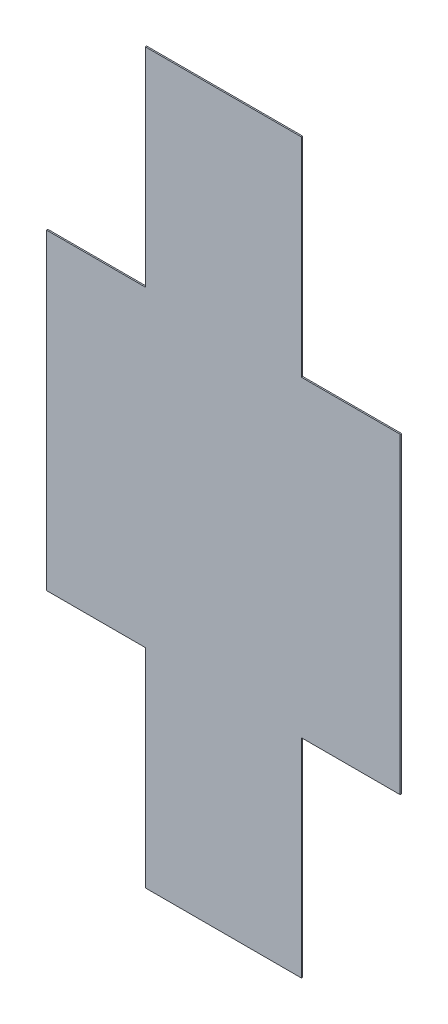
ISO-10303-21;
HEADER;
FILE_DESCRIPTION(('STEP AP214'),'2;1');
FILE_NAME('part.step','',(''),(''),'','','');
FILE_SCHEMA(('AUTOMOTIVE_DESIGN { 1 0 10303 214 1 1 1 1 }'));
ENDSEC;
DATA;
#1=APPLICATION_CONTEXT('core data for automotive mechanical design processes');
#2=APPLICATION_PROTOCOL_DEFINITION('international standard','automotive_design',2000,#1);
#3=PRODUCT_CONTEXT('',#1,'mechanical');
#4=PRODUCT('Part','Part','',(#3));
#5=PRODUCT_RELATED_PRODUCT_CATEGORY('part','',(#4));
#6=PRODUCT_DEFINITION_FORMATION('','',#4);
#7=PRODUCT_DEFINITION_CONTEXT('part definition',#1,'design');
#8=PRODUCT_DEFINITION('design','',#6,#7);
#9=PRODUCT_DEFINITION_SHAPE('','',#8);
#10=(LENGTH_UNIT() NAMED_UNIT(*) SI_UNIT(.MILLI.,.METRE.));
#11=(NAMED_UNIT(*) PLANE_ANGLE_UNIT() SI_UNIT($,.RADIAN.));
#12=(NAMED_UNIT(*) SI_UNIT($,.STERADIAN.) SOLID_ANGLE_UNIT());
#13=UNCERTAINTY_MEASURE_WITH_UNIT(LENGTH_MEASURE(1.E-05),#10,'distance_accuracy_value','');
#14=(GEOMETRIC_REPRESENTATION_CONTEXT(3) GLOBAL_UNCERTAINTY_ASSIGNED_CONTEXT((#13)) GLOBAL_UNIT_ASSIGNED_CONTEXT((#10,
#11,#12)) REPRESENTATION_CONTEXT('',''));
#15=CARTESIAN_POINT('',(0.,0.,0.));
#16=DIRECTION('',(0.,0.,1.));
#17=DIRECTION('',(1.,0.,0.));
#18=AXIS2_PLACEMENT_3D('',#15,#16,#17);
#19=CARTESIAN_POINT('',(-38.,35.,0.13));
#20=DIRECTION('',(0.,-1.,0.));
#21=DIRECTION('',(0.,0.,-1.));
#22=AXIS2_PLACEMENT_3D('',#19,#20,#21);
#23=PLANE('',#22);
#24=DIRECTION('',(-1.,0.,0.));
#25=VECTOR('',#24,1.);
#26=CARTESIAN_POINT('',(-38.,35.,0.));
#27=LINE('',#26,#25);
#28=CARTESIAN_POINT('',(7.5,35.,0.));
#29=VERTEX_POINT('',#28);
#30=CARTESIAN_POINT('',(-7.5,35.,0.));
#31=VERTEX_POINT('',#30);
#32=EDGE_CURVE('E150',#29,#31,#27,.T.);
#33=ORIENTED_EDGE('',*,*,#32,.T.);
#34=DIRECTION('',(0.,0.,1.));
#35=VECTOR('',#34,1.);
#36=CARTESIAN_POINT('',(-7.5,35.,0.));
#37=LINE('',#36,#35);
#38=CARTESIAN_POINT('',(-7.5,35.,0.13));
#39=VERTEX_POINT('',#38);
#40=EDGE_CURVE('E154',#31,#39,#37,.T.);
#41=ORIENTED_EDGE('',*,*,#40,.T.);
#42=DIRECTION('',(-1.,0.,0.));
#43=VECTOR('',#42,1.);
#44=CARTESIAN_POINT('',(-38.,35.,0.13));
#45=LINE('',#44,#43);
#46=CARTESIAN_POINT('',(7.5,35.,0.13));
#47=VERTEX_POINT('',#46);
#48=EDGE_CURVE('E45',#47,#39,#45,.T.);
#49=ORIENTED_EDGE('',*,*,#48,.F.);
#50=DIRECTION('',(0.,0.,1.));
#51=VECTOR('',#50,1.);
#52=CARTESIAN_POINT('',(7.5,35.,0.));
#53=LINE('',#52,#51);
#54=EDGE_CURVE('E188',#29,#47,#53,.T.);
#55=ORIENTED_EDGE('',*,*,#54,.F.);
#56=EDGE_LOOP('',(#33,#41,#49,#55));
#57=FACE_BOUND('',#56,.T.);
#58=ADVANCED_FACE('F37',(#57),#23,.F.);
#59=CARTESIAN_POINT('',(-38.,-35.,0.13));
#60=DIRECTION('',(0.,1.,0.));
#61=DIRECTION('',(0.,0.,1.));
#62=AXIS2_PLACEMENT_3D('',#59,#60,#61);
#63=PLANE('',#62);
#64=DIRECTION('',(1.,0.,0.));
#65=VECTOR('',#64,1.);
#66=CARTESIAN_POINT('',(-38.,-35.,0.13));
#67=LINE('',#66,#65);
#68=CARTESIAN_POINT('',(-7.5,-35.,0.13));
#69=VERTEX_POINT('',#68);
#70=CARTESIAN_POINT('',(7.5,-35.,0.13));
#71=VERTEX_POINT('',#70);
#72=EDGE_CURVE('E11',#69,#71,#67,.T.);
#73=ORIENTED_EDGE('',*,*,#72,.F.);
#74=DIRECTION('',(0.,0.,1.));
#75=VECTOR('',#74,1.);
#76=CARTESIAN_POINT('',(-7.5,-35.,0.));
#77=LINE('',#76,#75);
#78=CARTESIAN_POINT('',(-7.5,-35.,0.));
#79=VERTEX_POINT('',#78);
#80=EDGE_CURVE('E130',#79,#69,#77,.T.);
#81=ORIENTED_EDGE('',*,*,#80,.F.);
#82=DIRECTION('',(1.,0.,0.));
#83=VECTOR('',#82,1.);
#84=CARTESIAN_POINT('',(-38.,-35.,0.));
#85=LINE('',#84,#83);
#86=CARTESIAN_POINT('',(7.5,-35.,0.));
#87=VERTEX_POINT('',#86);
#88=EDGE_CURVE('E40',#79,#87,#85,.T.);
#89=ORIENTED_EDGE('',*,*,#88,.T.);
#90=DIRECTION('',(0.,0.,1.));
#91=VECTOR('',#90,1.);
#92=CARTESIAN_POINT('',(7.5,-35.,0.));
#93=LINE('',#92,#91);
#94=EDGE_CURVE('E190',#87,#71,#93,.T.);
#95=ORIENTED_EDGE('',*,*,#94,.T.);
#96=EDGE_LOOP('',(#73,#81,#89,#95));
#97=FACE_BOUND('',#96,.T.);
#98=ADVANCED_FACE('F140',(#97),#63,.F.);
#99=CARTESIAN_POINT('',(0.,0.,0.13));
#100=DIRECTION('',(0.,0.,1.));
#101=DIRECTION('',(1.,0.,0.));
#102=AXIS2_PLACEMENT_3D('',#99,#100,#101);
#103=PLANE('',#102);
#104=DIRECTION('',(0.,1.,0.));
#105=VECTOR('',#104,1.);
#106=CARTESIAN_POINT('',(-7.5,35.,0.13));
#107=LINE('',#106,#105);
#108=CARTESIAN_POINT('',(-7.5,15.,0.13));
#109=VERTEX_POINT('',#108);
#110=EDGE_CURVE('E135',#109,#39,#107,.T.);
#111=ORIENTED_EDGE('',*,*,#110,.F.);
#112=DIRECTION('',(1.,0.,0.));
#113=VECTOR('',#112,1.);
#114=CARTESIAN_POINT('',(-17.,15.,0.13));
#115=LINE('',#114,#113);
#116=CARTESIAN_POINT('',(-17.,15.,0.13));
#117=VERTEX_POINT('',#116);
#118=EDGE_CURVE('E206',#117,#109,#115,.T.);
#119=ORIENTED_EDGE('',*,*,#118,.F.);
#120=DIRECTION('',(0.,1.,0.));
#121=VECTOR('',#120,1.);
#122=CARTESIAN_POINT('',(-17.,-15.,0.13));
#123=LINE('',#122,#121);
#124=CARTESIAN_POINT('',(-17.,-15.,0.13));
#125=VERTEX_POINT('',#124);
#126=EDGE_CURVE('E209',#125,#117,#123,.T.);
#127=ORIENTED_EDGE('',*,*,#126,.F.);
#128=DIRECTION('',(-1.,0.,0.));
#129=VECTOR('',#128,1.);
#130=CARTESIAN_POINT('',(-17.,-15.,0.13));
#131=LINE('',#130,#129);
#132=CARTESIAN_POINT('',(-7.5,-15.,0.13));
#133=VERTEX_POINT('',#132);
#134=EDGE_CURVE('E212',#133,#125,#131,.T.);
#135=ORIENTED_EDGE('',*,*,#134,.F.);
#136=DIRECTION('',(0.,1.,0.));
#137=VECTOR('',#136,1.);
#138=CARTESIAN_POINT('',(-7.5,-35.,0.13));
#139=LINE('',#138,#137);
#140=EDGE_CURVE('E177',#69,#133,#139,.T.);
#141=ORIENTED_EDGE('',*,*,#140,.F.);
#142=ORIENTED_EDGE('',*,*,#72,.T.);
#143=DIRECTION('',(0.,-1.,0.));
#144=VECTOR('',#143,1.);
#145=CARTESIAN_POINT('',(7.5,-35.,0.13));
#146=LINE('',#145,#144);
#147=CARTESIAN_POINT('',(7.5,-15.,0.13));
#148=VERTEX_POINT('',#147);
#149=EDGE_CURVE('E165',#148,#71,#146,.T.);
#150=ORIENTED_EDGE('',*,*,#149,.F.);
#151=DIRECTION('',(-1.,0.,0.));
#152=VECTOR('',#151,1.);
#153=CARTESIAN_POINT('',(17.,-15.,0.13));
#154=LINE('',#153,#152);
#155=CARTESIAN_POINT('',(17.,-15.,0.13));
#156=VERTEX_POINT('',#155);
#157=EDGE_CURVE('E184',#156,#148,#154,.T.);
#158=ORIENTED_EDGE('',*,*,#157,.F.);
#159=DIRECTION('',(0.,-1.,0.));
#160=VECTOR('',#159,1.);
#161=CARTESIAN_POINT('',(17.,-15.,0.13));
#162=LINE('',#161,#160);
#163=CARTESIAN_POINT('',(17.,15.,0.13));
#164=VERTEX_POINT('',#163);
#165=EDGE_CURVE('E181',#164,#156,#162,.T.);
#166=ORIENTED_EDGE('',*,*,#165,.F.);
#167=DIRECTION('',(1.,0.,0.));
#168=VECTOR('',#167,1.);
#169=CARTESIAN_POINT('',(17.,15.,0.13));
#170=LINE('',#169,#168);
#171=CARTESIAN_POINT('',(7.5,15.,0.13));
#172=VERTEX_POINT('',#171);
#173=EDGE_CURVE('E178',#172,#164,#170,.T.);
#174=ORIENTED_EDGE('',*,*,#173,.F.);
#175=DIRECTION('',(0.,-1.,0.));
#176=VECTOR('',#175,1.);
#177=CARTESIAN_POINT('',(7.5,35.,0.13));
#178=LINE('',#177,#176);
#179=EDGE_CURVE('E174',#47,#172,#178,.T.);
#180=ORIENTED_EDGE('',*,*,#179,.F.);
#181=ORIENTED_EDGE('',*,*,#48,.T.);
#182=EDGE_LOOP('',(#111,#119,#127,#135,#141,#142,#150,#158,#166,#174,#180,#181));
#183=FACE_BOUND('',#182,.T.);
#184=ADVANCED_FACE('F241',(#183),#103,.T.);
#185=CARTESIAN_POINT('',(0.,0.,0.));
#186=DIRECTION('',(0.,0.,1.));
#187=DIRECTION('',(1.,0.,0.));
#188=AXIS2_PLACEMENT_3D('',#185,#186,#187);
#189=PLANE('',#188);
#190=DIRECTION('',(1.,0.,0.));
#191=VECTOR('',#190,1.);
#192=CARTESIAN_POINT('',(-17.,15.,0.));
#193=LINE('',#192,#191);
#194=CARTESIAN_POINT('',(-17.,15.,0.));
#195=VERTEX_POINT('',#194);
#196=CARTESIAN_POINT('',(-7.5,15.,0.));
#197=VERTEX_POINT('',#196);
#198=EDGE_CURVE('E218',#195,#197,#193,.T.);
#199=ORIENTED_EDGE('',*,*,#198,.T.);
#200=DIRECTION('',(0.,1.,0.));
#201=VECTOR('',#200,1.);
#202=CARTESIAN_POINT('',(-7.5,35.,0.));
#203=LINE('',#202,#201);
#204=EDGE_CURVE('E142',#197,#31,#203,.T.);
#205=ORIENTED_EDGE('',*,*,#204,.T.);
#206=ORIENTED_EDGE('',*,*,#32,.F.);
#207=DIRECTION('',(0.,-1.,0.));
#208=VECTOR('',#207,1.);
#209=CARTESIAN_POINT('',(7.5,35.,0.));
#210=LINE('',#209,#208);
#211=CARTESIAN_POINT('',(7.5,15.,0.));
#212=VERTEX_POINT('',#211);
#213=EDGE_CURVE('E162',#29,#212,#210,.T.);
#214=ORIENTED_EDGE('',*,*,#213,.T.);
#215=DIRECTION('',(1.,0.,0.));
#216=VECTOR('',#215,1.);
#217=CARTESIAN_POINT('',(17.,15.,0.));
#218=LINE('',#217,#216);
#219=CARTESIAN_POINT('',(17.,15.,0.));
#220=VERTEX_POINT('',#219);
#221=EDGE_CURVE('E166',#212,#220,#218,.T.);
#222=ORIENTED_EDGE('',*,*,#221,.T.);
#223=DIRECTION('',(0.,-1.,0.));
#224=VECTOR('',#223,1.);
#225=CARTESIAN_POINT('',(17.,-15.,0.));
#226=LINE('',#225,#224);
#227=CARTESIAN_POINT('',(17.,-15.,0.));
#228=VERTEX_POINT('',#227);
#229=EDGE_CURVE('E61',#220,#228,#226,.T.);
#230=ORIENTED_EDGE('',*,*,#229,.T.);
#231=DIRECTION('',(-1.,0.,0.));
#232=VECTOR('',#231,1.);
#233=CARTESIAN_POINT('',(17.,-15.,0.));
#234=LINE('',#233,#232);
#235=CARTESIAN_POINT('',(7.5,-15.,0.));
#236=VERTEX_POINT('',#235);
#237=EDGE_CURVE('E170',#228,#236,#234,.T.);
#238=ORIENTED_EDGE('',*,*,#237,.T.);
#239=DIRECTION('',(0.,-1.,0.));
#240=VECTOR('',#239,1.);
#241=CARTESIAN_POINT('',(7.5,-35.,0.));
#242=LINE('',#241,#240);
#243=EDGE_CURVE('E149',#236,#87,#242,.T.);
#244=ORIENTED_EDGE('',*,*,#243,.T.);
#245=ORIENTED_EDGE('',*,*,#88,.F.);
#246=DIRECTION('',(0.,1.,0.));
#247=VECTOR('',#246,1.);
#248=CARTESIAN_POINT('',(-7.5,-35.,0.));
#249=LINE('',#248,#247);
#250=CARTESIAN_POINT('',(-7.5,-15.,0.));
#251=VERTEX_POINT('',#250);
#252=EDGE_CURVE('E126',#79,#251,#249,.T.);
#253=ORIENTED_EDGE('',*,*,#252,.T.);
#254=DIRECTION('',(-1.,0.,0.));
#255=VECTOR('',#254,1.);
#256=CARTESIAN_POINT('',(-17.,-15.,0.));
#257=LINE('',#256,#255);
#258=CARTESIAN_POINT('',(-17.,-15.,0.));
#259=VERTEX_POINT('',#258);
#260=EDGE_CURVE('E53',#251,#259,#257,.T.);
#261=ORIENTED_EDGE('',*,*,#260,.T.);
#262=DIRECTION('',(0.,1.,0.));
#263=VECTOR('',#262,1.);
#264=CARTESIAN_POINT('',(-17.,-15.,0.));
#265=LINE('',#264,#263);
#266=EDGE_CURVE('E220',#259,#195,#265,.T.);
#267=ORIENTED_EDGE('',*,*,#266,.T.);
#268=EDGE_LOOP('',(#199,#205,#206,#214,#222,#230,#238,#244,#245,#253,#261,#267));
#269=FACE_BOUND('',#268,.T.);
#270=ADVANCED_FACE('F146',(#269),#189,.F.);
#271=CARTESIAN_POINT('',(7.5,35.,0.));
#272=DIRECTION('',(-1.,0.,0.));
#273=DIRECTION('',(0.,-1.,0.));
#274=AXIS2_PLACEMENT_3D('',#271,#272,#273);
#275=PLANE('',#274);
#276=ORIENTED_EDGE('',*,*,#179,.T.);
#277=DIRECTION('',(0.,0.,1.));
#278=VECTOR('',#277,1.);
#279=CARTESIAN_POINT('',(7.5,15.,0.));
#280=LINE('',#279,#278);
#281=EDGE_CURVE('E173',#212,#172,#280,.T.);
#282=ORIENTED_EDGE('',*,*,#281,.F.);
#283=ORIENTED_EDGE('',*,*,#213,.F.);
#284=ORIENTED_EDGE('',*,*,#54,.T.);
#285=EDGE_LOOP('',(#276,#282,#283,#284));
#286=FACE_BOUND('',#285,.T.);
#287=ADVANCED_FACE('F237',(#286),#275,.F.);
#288=CARTESIAN_POINT('',(7.5,-35.,0.));
#289=DIRECTION('',(-1.,0.,0.));
#290=DIRECTION('',(0.,-1.,0.));
#291=AXIS2_PLACEMENT_3D('',#288,#289,#290);
#292=PLANE('',#291);
#293=ORIENTED_EDGE('',*,*,#149,.T.);
#294=ORIENTED_EDGE('',*,*,#94,.F.);
#295=ORIENTED_EDGE('',*,*,#243,.F.);
#296=DIRECTION('',(0.,0.,1.));
#297=VECTOR('',#296,1.);
#298=CARTESIAN_POINT('',(7.5,-15.,0.));
#299=LINE('',#298,#297);
#300=EDGE_CURVE('E192',#236,#148,#299,.T.);
#301=ORIENTED_EDGE('',*,*,#300,.T.);
#302=EDGE_LOOP('',(#293,#294,#295,#301));
#303=FACE_BOUND('',#302,.T.);
#304=ADVANCED_FACE('F253',(#303),#292,.F.);
#305=CARTESIAN_POINT('',(17.,-15.,0.));
#306=DIRECTION('',(0.,1.,0.));
#307=DIRECTION('',(0.,0.,1.));
#308=AXIS2_PLACEMENT_3D('',#305,#306,#307);
#309=PLANE('',#308);
#310=ORIENTED_EDGE('',*,*,#157,.T.);
#311=ORIENTED_EDGE('',*,*,#300,.F.);
#312=ORIENTED_EDGE('',*,*,#237,.F.);
#313=DIRECTION('',(0.,0.,1.));
#314=VECTOR('',#313,1.);
#315=CARTESIAN_POINT('',(17.,-15.,0.));
#316=LINE('',#315,#314);
#317=EDGE_CURVE('E194',#228,#156,#316,.T.);
#318=ORIENTED_EDGE('',*,*,#317,.T.);
#319=EDGE_LOOP('',(#310,#311,#312,#318));
#320=FACE_BOUND('',#319,.T.);
#321=ADVANCED_FACE('F251',(#320),#309,.F.);
#322=CARTESIAN_POINT('',(17.,-15.,0.));
#323=DIRECTION('',(-1.,0.,0.));
#324=DIRECTION('',(0.,-1.,0.));
#325=AXIS2_PLACEMENT_3D('',#322,#323,#324);
#326=PLANE('',#325);
#327=ORIENTED_EDGE('',*,*,#165,.T.);
#328=ORIENTED_EDGE('',*,*,#317,.F.);
#329=ORIENTED_EDGE('',*,*,#229,.F.);
#330=DIRECTION('',(0.,0.,1.));
#331=VECTOR('',#330,1.);
#332=CARTESIAN_POINT('',(17.,15.,0.));
#333=LINE('',#332,#331);
#334=EDGE_CURVE('E196',#220,#164,#333,.T.);
#335=ORIENTED_EDGE('',*,*,#334,.T.);
#336=EDGE_LOOP('',(#327,#328,#329,#335));
#337=FACE_BOUND('',#336,.T.);
#338=ADVANCED_FACE('F247',(#337),#326,.F.);
#339=CARTESIAN_POINT('',(17.,15.,0.));
#340=DIRECTION('',(0.,-1.,0.));
#341=DIRECTION('',(1.,0.,0.));
#342=AXIS2_PLACEMENT_3D('',#339,#340,#341);
#343=PLANE('',#342);
#344=ORIENTED_EDGE('',*,*,#173,.T.);
#345=ORIENTED_EDGE('',*,*,#334,.F.);
#346=ORIENTED_EDGE('',*,*,#221,.F.);
#347=ORIENTED_EDGE('',*,*,#281,.T.);
#348=EDGE_LOOP('',(#344,#345,#346,#347));
#349=FACE_BOUND('',#348,.T.);
#350=ADVANCED_FACE('F246',(#349),#343,.F.);
#351=CARTESIAN_POINT('',(-7.5,35.,0.));
#352=DIRECTION('',(1.,0.,0.));
#353=DIRECTION('',(0.,1.,0.));
#354=AXIS2_PLACEMENT_3D('',#351,#352,#353);
#355=PLANE('',#354);
#356=ORIENTED_EDGE('',*,*,#110,.T.);
#357=ORIENTED_EDGE('',*,*,#40,.F.);
#358=ORIENTED_EDGE('',*,*,#204,.F.);
#359=DIRECTION('',(0.,0.,1.));
#360=VECTOR('',#359,1.);
#361=CARTESIAN_POINT('',(-7.5,15.,0.));
#362=LINE('',#361,#360);
#363=EDGE_CURVE('E159',#197,#109,#362,.T.);
#364=ORIENTED_EDGE('',*,*,#363,.T.);
#365=EDGE_LOOP('',(#356,#357,#358,#364));
#366=FACE_BOUND('',#365,.T.);
#367=ADVANCED_FACE('F234',(#366),#355,.F.);
#368=CARTESIAN_POINT('',(-17.,15.,0.));
#369=DIRECTION('',(0.,-1.,0.));
#370=DIRECTION('',(1.,0.,0.));
#371=AXIS2_PLACEMENT_3D('',#368,#369,#370);
#372=PLANE('',#371);
#373=ORIENTED_EDGE('',*,*,#118,.T.);
#374=ORIENTED_EDGE('',*,*,#363,.F.);
#375=ORIENTED_EDGE('',*,*,#198,.F.);
#376=DIRECTION('',(0.,0.,1.));
#377=VECTOR('',#376,1.);
#378=CARTESIAN_POINT('',(-17.,15.,0.));
#379=LINE('',#378,#377);
#380=EDGE_CURVE('E202',#195,#117,#379,.T.);
#381=ORIENTED_EDGE('',*,*,#380,.T.);
#382=EDGE_LOOP('',(#373,#374,#375,#381));
#383=FACE_BOUND('',#382,.T.);
#384=ADVANCED_FACE('F230',(#383),#372,.F.);
#385=CARTESIAN_POINT('',(-17.,-15.,0.));
#386=DIRECTION('',(1.,0.,0.));
#387=DIRECTION('',(0.,0.,-1.));
#388=AXIS2_PLACEMENT_3D('',#385,#386,#387);
#389=PLANE('',#388);
#390=ORIENTED_EDGE('',*,*,#126,.T.);
#391=ORIENTED_EDGE('',*,*,#380,.F.);
#392=ORIENTED_EDGE('',*,*,#266,.F.);
#393=DIRECTION('',(0.,0.,1.));
#394=VECTOR('',#393,1.);
#395=CARTESIAN_POINT('',(-17.,-15.,0.));
#396=LINE('',#395,#394);
#397=EDGE_CURVE('E200',#259,#125,#396,.T.);
#398=ORIENTED_EDGE('',*,*,#397,.T.);
#399=EDGE_LOOP('',(#390,#391,#392,#398));
#400=FACE_BOUND('',#399,.T.);
#401=ADVANCED_FACE('F226',(#400),#389,.F.);
#402=CARTESIAN_POINT('',(-17.,-15.,0.));
#403=DIRECTION('',(0.,1.,0.));
#404=DIRECTION('',(-1.,0.,0.));
#405=AXIS2_PLACEMENT_3D('',#402,#403,#404);
#406=PLANE('',#405);
#407=ORIENTED_EDGE('',*,*,#134,.T.);
#408=ORIENTED_EDGE('',*,*,#397,.F.);
#409=ORIENTED_EDGE('',*,*,#260,.F.);
#410=DIRECTION('',(0.,0.,1.));
#411=VECTOR('',#410,1.);
#412=CARTESIAN_POINT('',(-7.5,-15.,0.));
#413=LINE('',#412,#411);
#414=EDGE_CURVE('E132',#251,#133,#413,.T.);
#415=ORIENTED_EDGE('',*,*,#414,.T.);
#416=EDGE_LOOP('',(#407,#408,#409,#415));
#417=FACE_BOUND('',#416,.T.);
#418=ADVANCED_FACE('F255',(#417),#406,.F.);
#419=CARTESIAN_POINT('',(-7.5,-35.,0.));
#420=DIRECTION('',(1.,0.,0.));
#421=DIRECTION('',(0.,1.,0.));
#422=AXIS2_PLACEMENT_3D('',#419,#420,#421);
#423=PLANE('',#422);
#424=ORIENTED_EDGE('',*,*,#140,.T.);
#425=ORIENTED_EDGE('',*,*,#414,.F.);
#426=ORIENTED_EDGE('',*,*,#252,.F.);
#427=ORIENTED_EDGE('',*,*,#80,.T.);
#428=EDGE_LOOP('',(#424,#425,#426,#427));
#429=FACE_BOUND('',#428,.T.);
#430=ADVANCED_FACE('F129',(#429),#423,.F.);
#431=CLOSED_SHELL('',(#58,#98,#184,#270,#287,#304,#321,#338,#350,#367,#384,#401,#418,#430));
#432=MANIFOLD_SOLID_BREP('B2',#431);
#433=ADVANCED_BREP_SHAPE_REPRESENTATION('',(#18,#432),#14);
#434=SHAPE_DEFINITION_REPRESENTATION(#9,#433);
ENDSEC;
END-ISO-10303-21;
